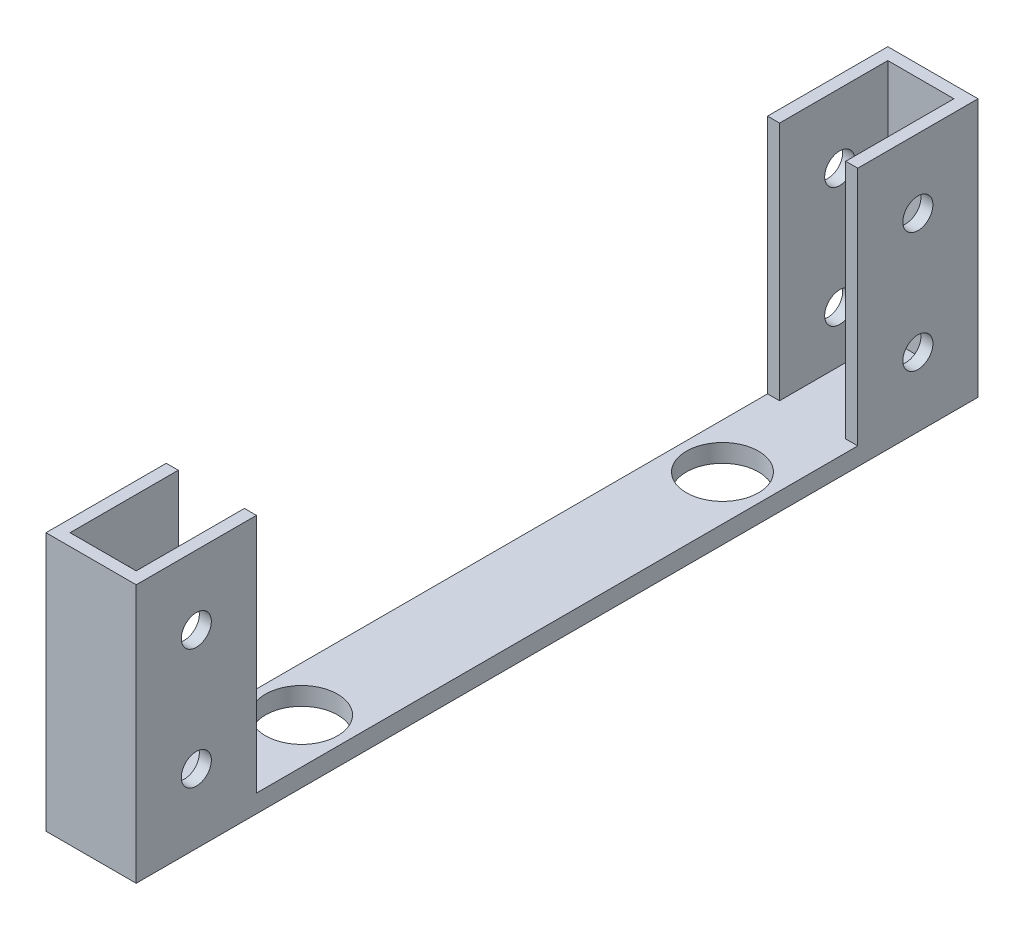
from build123d import *

# Parameters (mm, degrees)
CROQUIS1_W              = 15
CROQUIS1_H              = 140
SALIENTE_EXTRUIR2_DEPTH = 3
CROQUIS3_R              = 6
CORTAR_EXTRUIR1_DEPTH   = 3
SALIENTE_EXTRUIR3_DEPTH = 40
CROQUIS5_R              = 2.5
CORTAR_EXTRUIR2_DEPTH   = 15


with BuildPart() as part:
    # Croquis1 → Saliente-Extruir2 (new body)
    with BuildSketch(Plane(origin=(0, 0, 0), x_dir=(1, 0, 0), z_dir=(0, 1, 0))):
        Rectangle(CROQUIS1_W, CROQUIS1_H)
    extrude(amount=SALIENTE_EXTRUIR2_DEPTH)

    # Croquis3 → Cortar-Extruir1 (cut)
    with BuildSketch(Plane(origin=(0, 3, 0), x_dir=(1, 0, 0), z_dir=(0, 1, 0))):
        with Locations(Location((0, -35, 0), (0, 0, 270))):
            Circle(CROQUIS3_R)
        with Locations(Location((0, 35, 0), (0, 0, 270))):
            Circle(CROQUIS3_R)
    extrude(amount=-CORTAR_EXTRUIR1_DEPTH, mode=Mode.SUBTRACT)

    # Croquis4 → Saliente-Extruir3 (add)
    with BuildSketch(Plane(origin=(0, 3, 0), x_dir=(1, 0, 0), z_dir=(0, 1, 0))):
        Polygon((-7.5, 70), (7.5, 70), (7.5, 50), (5.5, 50), (5.5, 68), (-5.5, 68), (-5.5, 50), (-7.5, 50), align=None)
        Polygon((-7.5, -70), (7.5, -70), (7.5, -50), (5.5, -50), (5.5, -68), (-5.5, -68), (-5.5, -50), (-7.5, -50), align=None)
    extrude(amount=SALIENTE_EXTRUIR3_DEPTH)

    # Croquis5 → Cortar-Extruir2 (cut)
    with BuildSketch(Plane(origin=(7.5, 0, 0), x_dir=(0, 0, -1), z_dir=(1, 0, 0))):
        with Locations((-60, 31.5)):
            Circle(CROQUIS5_R)
        with Locations((-60, 11.5)):
            Circle(CROQUIS5_R)
        with Locations((60, 31.5)):
            Circle(CROQUIS5_R)
        with Locations((60, 11.5)):
            Circle(CROQUIS5_R)
    extrude(amount=-CORTAR_EXTRUIR2_DEPTH, mode=Mode.SUBTRACT)


solid = part.part
